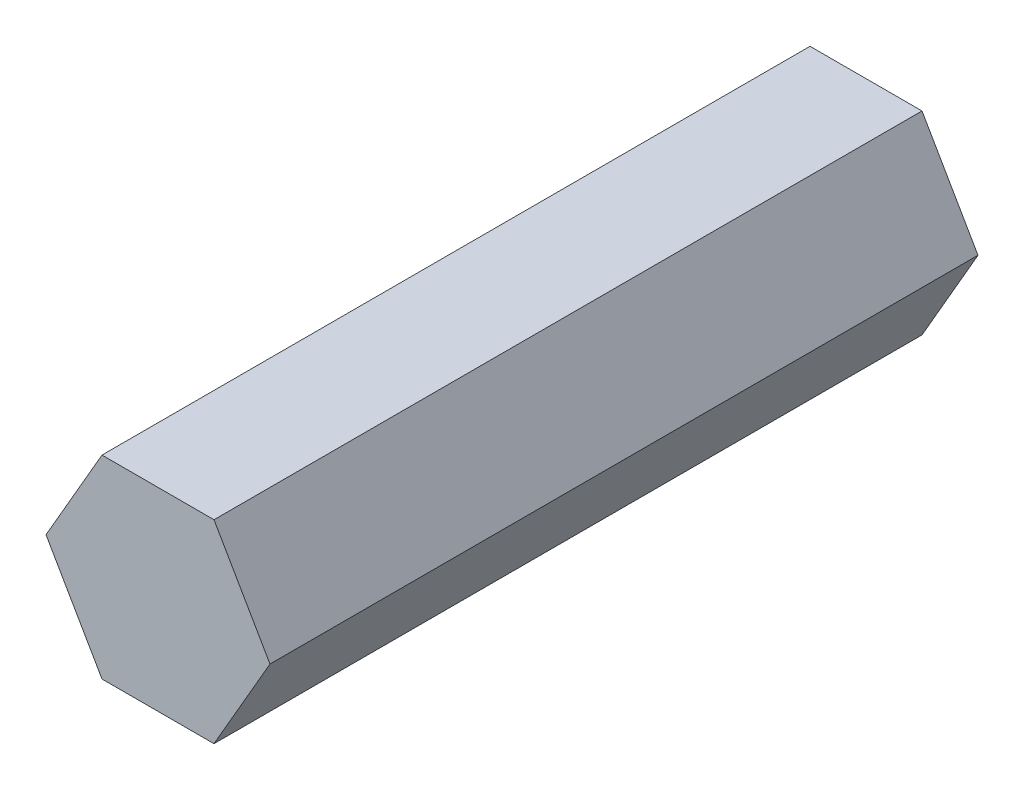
from build123d import *

# Parameters (mm, degrees)
BASE_EXTRUSION_START = -14.6
BASE_EXTRUSION_DEPTH = 14.6


with BuildPart() as part:
    # Esquisse1 → Base-Extrusion (new body)
    with BuildSketch(Plane.XY.offset(BASE_EXTRUSION_START)):
        Polygon((2.309401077, 0), (1.154700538, 2), (-1.154700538, 2), (-2.309401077, 0), (-1.154700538, -2), (1.154700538, -2), align=None)
    extrude(amount=BASE_EXTRUSION_DEPTH)


solid = part.part
